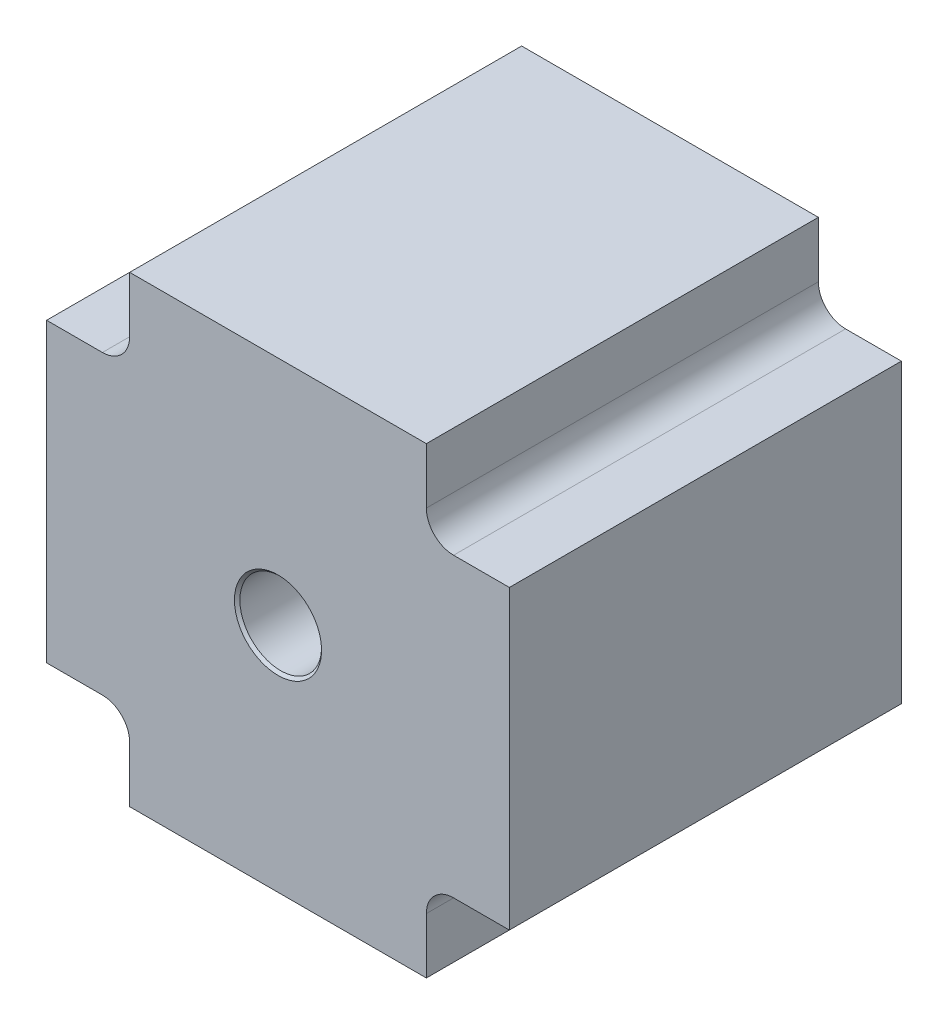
from build123d import *

# Parameters (mm, degrees)
EXTRUDE_1_DEPTH     = 72
SKETCH_3_R          = 7.5
CUT_EXTRUDE_2_DEPTH = 94.789658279
CHAMFER_3_SIZE      = 0.5
FILLET_1_R          = 5


with BuildPart() as part:
    # Sketch 1 → Extrude 1 (new body)
    with BuildSketch(Plane.XY):
        Polygon((27.25, 42.5), (-27.25, 42.5), (-27.25, 27.25), (-42.5, 27.25), (-42.5, -27.25), (-27.25, -27.25), (-27.25, -42.5), (27.25, -42.5), (27.25, -27.25), (42.5, -27.25), (42.5, 27.25), (27.25, 27.25), align=None)
    extrude(amount=EXTRUDE_1_DEPTH)

    # Sketch 3 → Cut-Extrude 2 (cut, through all)
    with BuildSketch(Plane.XY.offset(72)):
        Circle(SKETCH_3_R)
    extrude(amount=-CUT_EXTRUDE_2_DEPTH, mode=Mode.SUBTRACT)

    # Chamfer 3
    chamfer_3_edges = [part.edges().sort_by_distance(p)[0] for p in [
        (-7.5, 0, 0),
        (-7.5, 0, 72),
    ]]
    chamfer(chamfer_3_edges, length=CHAMFER_3_SIZE)

    # Fillet 1
    fillet_1_edges = [part.edges().sort_by_distance(p)[0] for p in [
        (-27.25, -27.25, 36),
        (-27.25, 27.25, 36),
        (27.25, 27.25, 36),
        (27.25, -27.25, 36),
    ]]
    fillet(fillet_1_edges, radius=FILLET_1_R)


solid = part.part
